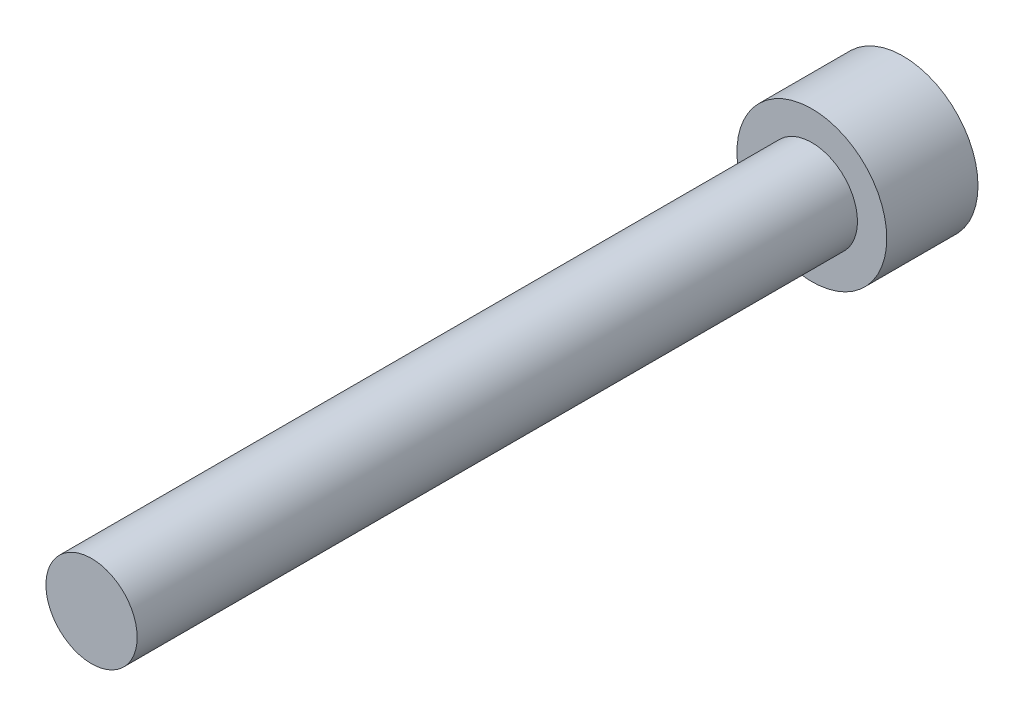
ISO-10303-21;
HEADER;
FILE_DESCRIPTION(('STEP AP214'),'2;1');
FILE_NAME('part.step','',(''),(''),'','','');
FILE_SCHEMA(('AUTOMOTIVE_DESIGN { 1 0 10303 214 1 1 1 1 }'));
ENDSEC;
DATA;
#1=APPLICATION_CONTEXT('core data for automotive mechanical design processes');
#2=APPLICATION_PROTOCOL_DEFINITION('international standard','automotive_design',2000,#1);
#3=PRODUCT_CONTEXT('',#1,'mechanical');
#4=PRODUCT('Part','Part','',(#3));
#5=PRODUCT_RELATED_PRODUCT_CATEGORY('part','',(#4));
#6=PRODUCT_DEFINITION_FORMATION('','',#4);
#7=PRODUCT_DEFINITION_CONTEXT('part definition',#1,'design');
#8=PRODUCT_DEFINITION('design','',#6,#7);
#9=PRODUCT_DEFINITION_SHAPE('','',#8);
#10=(LENGTH_UNIT() NAMED_UNIT(*) SI_UNIT(.MILLI.,.METRE.));
#11=(NAMED_UNIT(*) PLANE_ANGLE_UNIT() SI_UNIT($,.RADIAN.));
#12=(NAMED_UNIT(*) SI_UNIT($,.STERADIAN.) SOLID_ANGLE_UNIT());
#13=UNCERTAINTY_MEASURE_WITH_UNIT(LENGTH_MEASURE(1.E-05),#10,'distance_accuracy_value','');
#14=(GEOMETRIC_REPRESENTATION_CONTEXT(3) GLOBAL_UNCERTAINTY_ASSIGNED_CONTEXT((#13)) GLOBAL_UNIT_ASSIGNED_CONTEXT((#10,
#11,#12)) REPRESENTATION_CONTEXT('',''));
#15=CARTESIAN_POINT('',(0.,0.,0.));
#16=DIRECTION('',(0.,0.,1.));
#17=DIRECTION('',(1.,0.,0.));
#18=AXIS2_PLACEMENT_3D('',#15,#16,#17);
#19=CARTESIAN_POINT('',(0.,0.,38.1));
#20=DIRECTION('',(0.,0.,1.));
#21=DIRECTION('',(1.,0.,0.));
#22=AXIS2_PLACEMENT_3D('',#19,#20,#21);
#23=PLANE('',#22);
#24=CARTESIAN_POINT('',(0.,0.,38.1));
#25=DIRECTION('',(0.,0.,1.));
#26=DIRECTION('',(1.,0.,0.));
#27=AXIS2_PLACEMENT_3D('',#24,#25,#26);
#28=CIRCLE('',#27,2.413);
#29=CARTESIAN_POINT('',(2.413,0.,38.1));
#30=VERTEX_POINT('',#29);
#31=EDGE_CURVE('E11',#30,#30,#28,.T.);
#32=ORIENTED_EDGE('',*,*,#31,.T.);
#33=EDGE_LOOP('',(#32));
#34=FACE_BOUND('',#33,.T.);
#35=ADVANCED_FACE('F37',(#34),#23,.T.);
#36=CARTESIAN_POINT('',(0.,0.,38.1));
#37=DIRECTION('',(0.,0.,1.));
#38=DIRECTION('',(1.,0.,0.));
#39=AXIS2_PLACEMENT_3D('',#36,#37,#38);
#40=CYLINDRICAL_SURFACE('',#39,2.413);
#41=CARTESIAN_POINT('',(0.,0.,0.));
#42=DIRECTION('',(0.,0.,1.));
#43=DIRECTION('',(1.,0.,0.));
#44=AXIS2_PLACEMENT_3D('',#41,#42,#43);
#45=CIRCLE('',#44,2.413);
#46=CARTESIAN_POINT('',(2.413,0.,0.));
#47=VERTEX_POINT('',#46);
#48=EDGE_CURVE('E44',#47,#47,#45,.T.);
#49=ORIENTED_EDGE('',*,*,#48,.T.);
#50=EDGE_LOOP('',(#49));
#51=FACE_BOUND('',#50,.T.);
#52=ORIENTED_EDGE('',*,*,#31,.F.);
#53=EDGE_LOOP('',(#52));
#54=FACE_BOUND('',#53,.T.);
#55=ADVANCED_FACE('F151',(#51,#54),#40,.T.);
#56=CARTESIAN_POINT('',(0.,-2.413,0.));
#57=DIRECTION('',(0.,0.,1.));
#58=DIRECTION('',(1.,0.,0.));
#59=AXIS2_PLACEMENT_3D('',#56,#57,#58);
#60=PLANE('',#59);
#61=CARTESIAN_POINT('',(0.,0.,0.));
#62=DIRECTION('',(0.,0.,1.));
#63=DIRECTION('',(1.,0.,0.));
#64=AXIS2_PLACEMENT_3D('',#61,#62,#63);
#65=CIRCLE('',#64,3.9624);
#66=CARTESIAN_POINT('',(3.9624,0.,0.));
#67=VERTEX_POINT('',#66);
#68=EDGE_CURVE('E146',#67,#67,#65,.T.);
#69=ORIENTED_EDGE('',*,*,#68,.T.);
#70=EDGE_LOOP('',(#69));
#71=FACE_BOUND('',#70,.T.);
#72=ORIENTED_EDGE('',*,*,#48,.F.);
#73=EDGE_LOOP('',(#72));
#74=FACE_BOUND('',#73,.T.);
#75=ADVANCED_FACE('F154',(#71,#74),#60,.T.);
#76=CARTESIAN_POINT('',(0.,0.,38.1));
#77=DIRECTION('',(0.,0.,1.));
#78=DIRECTION('',(1.,0.,0.));
#79=AXIS2_PLACEMENT_3D('',#76,#77,#78);
#80=CYLINDRICAL_SURFACE('',#79,3.9624);
#81=CARTESIAN_POINT('',(0.,0.,-4.826));
#82=DIRECTION('',(0.,0.,1.));
#83=DIRECTION('',(1.,0.,0.));
#84=AXIS2_PLACEMENT_3D('',#81,#82,#83);
#85=CIRCLE('',#84,3.9624);
#86=CARTESIAN_POINT('',(3.9624,0.,-4.826));
#87=VERTEX_POINT('',#86);
#88=EDGE_CURVE('E138',#87,#87,#85,.T.);
#89=ORIENTED_EDGE('',*,*,#88,.T.);
#90=EDGE_LOOP('',(#89));
#91=FACE_BOUND('',#90,.T.);
#92=ORIENTED_EDGE('',*,*,#68,.F.);
#93=EDGE_LOOP('',(#92));
#94=FACE_BOUND('',#93,.T.);
#95=ADVANCED_FACE('F156',(#91,#94),#80,.T.);
#96=CARTESIAN_POINT('',(0.,-3.9624,-4.826));
#97=DIRECTION('',(0.,0.,-1.));
#98=DIRECTION('',(-1.,0.,0.));
#99=AXIS2_PLACEMENT_3D('',#96,#97,#98);
#100=PLANE('',#99);
#101=DIRECTION('',(0.866025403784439,-0.5,0.));
#102=VECTOR('',#101,1.);
#103=CARTESIAN_POINT('',(0.,2.28769270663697,-4.826));
#104=LINE('',#103,#102);
#105=CARTESIAN_POINT('',(0.,2.28769270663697,-4.826));
#106=VERTEX_POINT('',#105);
#107=CARTESIAN_POINT('',(1.9812,1.14384635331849,-4.826));
#108=VERTEX_POINT('',#107);
#109=EDGE_CURVE('E51',#106,#108,#104,.T.);
#110=ORIENTED_EDGE('',*,*,#109,.F.);
#111=DIRECTION('',(0.866025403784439,0.5,0.));
#112=VECTOR('',#111,1.);
#113=CARTESIAN_POINT('',(-1.9812,1.14384635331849,-4.826));
#114=LINE('',#113,#112);
#115=CARTESIAN_POINT('',(-1.9812,1.14384635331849,-4.826));
#116=VERTEX_POINT('',#115);
#117=EDGE_CURVE('E134',#116,#106,#114,.T.);
#118=ORIENTED_EDGE('',*,*,#117,.F.);
#119=DIRECTION('',(0.,1.,0.));
#120=VECTOR('',#119,1.);
#121=CARTESIAN_POINT('',(-1.9812,-1.14384635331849,-4.826));
#122=LINE('',#121,#120);
#123=CARTESIAN_POINT('',(-1.9812,-1.14384635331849,-4.826));
#124=VERTEX_POINT('',#123);
#125=EDGE_CURVE('E132',#124,#116,#122,.T.);
#126=ORIENTED_EDGE('',*,*,#125,.F.);
#127=DIRECTION('',(-0.866025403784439,0.5,0.));
#128=VECTOR('',#127,1.);
#129=CARTESIAN_POINT('',(0.,-2.28769270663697,-4.826));
#130=LINE('',#129,#128);
#131=CARTESIAN_POINT('',(0.,-2.28769270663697,-4.826));
#132=VERTEX_POINT('',#131);
#133=EDGE_CURVE('E99',#132,#124,#130,.T.);
#134=ORIENTED_EDGE('',*,*,#133,.F.);
#135=DIRECTION('',(-0.866025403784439,-0.5,0.));
#136=VECTOR('',#135,1.);
#137=CARTESIAN_POINT('',(1.9812,-1.14384635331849,-4.826));
#138=LINE('',#137,#136);
#139=CARTESIAN_POINT('',(1.9812,-1.14384635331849,-4.826));
#140=VERTEX_POINT('',#139);
#141=EDGE_CURVE('E128',#140,#132,#138,.T.);
#142=ORIENTED_EDGE('',*,*,#141,.F.);
#143=DIRECTION('',(0.,-1.,0.));
#144=VECTOR('',#143,1.);
#145=CARTESIAN_POINT('',(1.9812,1.14384635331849,-4.826));
#146=LINE('',#145,#144);
#147=EDGE_CURVE('E125',#108,#140,#146,.T.);
#148=ORIENTED_EDGE('',*,*,#147,.F.);
#149=EDGE_LOOP('',(#110,#118,#126,#134,#142,#148));
#150=FACE_BOUND('',#149,.T.);
#151=ORIENTED_EDGE('',*,*,#88,.F.);
#152=EDGE_LOOP('',(#151));
#153=FACE_BOUND('',#152,.T.);
#154=ADVANCED_FACE('F163',(#150,#153),#100,.T.);
#155=CARTESIAN_POINT('',(0.,2.28769270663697,-1.778));
#156=DIRECTION('',(0.5,0.866025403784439,0.));
#157=DIRECTION('',(-0.866025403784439,0.5,0.));
#158=AXIS2_PLACEMENT_3D('',#155,#156,#157);
#159=PLANE('',#158);
#160=ORIENTED_EDGE('',*,*,#109,.T.);
#161=DIRECTION('',(0.,0.,-1.));
#162=VECTOR('',#161,1.);
#163=CARTESIAN_POINT('',(1.9812,1.14384635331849,-1.778));
#164=LINE('',#163,#162);
#165=CARTESIAN_POINT('',(1.9812,1.14384635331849,-1.778));
#166=VERTEX_POINT('',#165);
#167=EDGE_CURVE('E81',#166,#108,#164,.T.);
#168=ORIENTED_EDGE('',*,*,#167,.F.);
#169=DIRECTION('',(0.866025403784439,-0.5,0.));
#170=VECTOR('',#169,1.);
#171=CARTESIAN_POINT('',(0.,2.28769270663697,-1.778));
#172=LINE('',#171,#170);
#173=CARTESIAN_POINT('',(0.,2.28769270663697,-1.778));
#174=VERTEX_POINT('',#173);
#175=EDGE_CURVE('E136',#174,#166,#172,.T.);
#176=ORIENTED_EDGE('',*,*,#175,.F.);
#177=DIRECTION('',(0.,0.,-1.));
#178=VECTOR('',#177,1.);
#179=CARTESIAN_POINT('',(0.,2.28769270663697,-1.778));
#180=LINE('',#179,#178);
#181=EDGE_CURVE('E59',#174,#106,#180,.T.);
#182=ORIENTED_EDGE('',*,*,#181,.T.);
#183=EDGE_LOOP('',(#160,#168,#176,#182));
#184=FACE_BOUND('',#183,.T.);
#185=ADVANCED_FACE('F197',(#184),#159,.F.);
#186=CARTESIAN_POINT('',(-1.9812,1.14384635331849,-1.778));
#187=DIRECTION('',(-0.5,0.866025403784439,0.));
#188=DIRECTION('',(-0.866025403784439,-0.5,0.));
#189=AXIS2_PLACEMENT_3D('',#186,#187,#188);
#190=PLANE('',#189);
#191=ORIENTED_EDGE('',*,*,#117,.T.);
#192=ORIENTED_EDGE('',*,*,#181,.F.);
#193=DIRECTION('',(0.866025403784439,0.5,0.));
#194=VECTOR('',#193,1.);
#195=CARTESIAN_POINT('',(-1.9812,1.14384635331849,-1.778));
#196=LINE('',#195,#194);
#197=CARTESIAN_POINT('',(-1.9812,1.14384635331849,-1.778));
#198=VERTEX_POINT('',#197);
#199=EDGE_CURVE('E111',#198,#174,#196,.T.);
#200=ORIENTED_EDGE('',*,*,#199,.F.);
#201=DIRECTION('',(0.,0.,-1.));
#202=VECTOR('',#201,1.);
#203=CARTESIAN_POINT('',(-1.9812,1.14384635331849,-1.778));
#204=LINE('',#203,#202);
#205=EDGE_CURVE('E103',#198,#116,#204,.T.);
#206=ORIENTED_EDGE('',*,*,#205,.T.);
#207=EDGE_LOOP('',(#191,#192,#200,#206));
#208=FACE_BOUND('',#207,.T.);
#209=ADVANCED_FACE('F208',(#208),#190,.F.);
#210=CARTESIAN_POINT('',(-1.9812,-1.14384635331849,-1.778));
#211=DIRECTION('',(-1.,0.,0.));
#212=DIRECTION('',(0.,-1.,0.));
#213=AXIS2_PLACEMENT_3D('',#210,#211,#212);
#214=PLANE('',#213);
#215=ORIENTED_EDGE('',*,*,#125,.T.);
#216=ORIENTED_EDGE('',*,*,#205,.F.);
#217=DIRECTION('',(0.,1.,0.));
#218=VECTOR('',#217,1.);
#219=CARTESIAN_POINT('',(-1.9812,-1.14384635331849,-1.778));
#220=LINE('',#219,#218);
#221=CARTESIAN_POINT('',(-1.9812,-1.14384635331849,-1.778));
#222=VERTEX_POINT('',#221);
#223=EDGE_CURVE('E107',#222,#198,#220,.T.);
#224=ORIENTED_EDGE('',*,*,#223,.F.);
#225=DIRECTION('',(0.,0.,-1.));
#226=VECTOR('',#225,1.);
#227=CARTESIAN_POINT('',(-1.9812,-1.14384635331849,-1.778));
#228=LINE('',#227,#226);
#229=EDGE_CURVE('E92',#222,#124,#228,.T.);
#230=ORIENTED_EDGE('',*,*,#229,.T.);
#231=EDGE_LOOP('',(#215,#216,#224,#230));
#232=FACE_BOUND('',#231,.T.);
#233=ADVANCED_FACE('F108',(#232),#214,.F.);
#234=CARTESIAN_POINT('',(0.,-2.28769270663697,-1.778));
#235=DIRECTION('',(-0.5,-0.866025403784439,0.));
#236=DIRECTION('',(0.866025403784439,-0.5,0.));
#237=AXIS2_PLACEMENT_3D('',#234,#235,#236);
#238=PLANE('',#237);
#239=ORIENTED_EDGE('',*,*,#133,.T.);
#240=ORIENTED_EDGE('',*,*,#229,.F.);
#241=DIRECTION('',(-0.866025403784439,0.5,0.));
#242=VECTOR('',#241,1.);
#243=CARTESIAN_POINT('',(0.,-2.28769270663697,-1.778));
#244=LINE('',#243,#242);
#245=CARTESIAN_POINT('',(0.,-2.28769270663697,-1.778));
#246=VERTEX_POINT('',#245);
#247=EDGE_CURVE('E96',#246,#222,#244,.T.);
#248=ORIENTED_EDGE('',*,*,#247,.F.);
#249=DIRECTION('',(0.,0.,-1.));
#250=VECTOR('',#249,1.);
#251=CARTESIAN_POINT('',(0.,-2.28769270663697,-1.778));
#252=LINE('',#251,#250);
#253=EDGE_CURVE('E104',#246,#132,#252,.T.);
#254=ORIENTED_EDGE('',*,*,#253,.T.);
#255=EDGE_LOOP('',(#239,#240,#248,#254));
#256=FACE_BOUND('',#255,.T.);
#257=ADVANCED_FACE('F94',(#256),#238,.F.);
#258=CARTESIAN_POINT('',(1.9812,-1.14384635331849,-1.778));
#259=DIRECTION('',(0.5,-0.866025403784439,0.));
#260=DIRECTION('',(0.866025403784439,0.5,0.));
#261=AXIS2_PLACEMENT_3D('',#258,#259,#260);
#262=PLANE('',#261);
#263=ORIENTED_EDGE('',*,*,#141,.T.);
#264=ORIENTED_EDGE('',*,*,#253,.F.);
#265=DIRECTION('',(-0.866025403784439,-0.5,0.));
#266=VECTOR('',#265,1.);
#267=CARTESIAN_POINT('',(1.9812,-1.14384635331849,-1.778));
#268=LINE('',#267,#266);
#269=CARTESIAN_POINT('',(1.9812,-1.14384635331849,-1.778));
#270=VERTEX_POINT('',#269);
#271=EDGE_CURVE('E117',#270,#246,#268,.T.);
#272=ORIENTED_EDGE('',*,*,#271,.F.);
#273=DIRECTION('',(0.,0.,-1.));
#274=VECTOR('',#273,1.);
#275=CARTESIAN_POINT('',(1.9812,-1.14384635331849,-1.778));
#276=LINE('',#275,#274);
#277=EDGE_CURVE('E141',#270,#140,#276,.T.);
#278=ORIENTED_EDGE('',*,*,#277,.T.);
#279=EDGE_LOOP('',(#263,#264,#272,#278));
#280=FACE_BOUND('',#279,.T.);
#281=ADVANCED_FACE('F236',(#280),#262,.F.);
#282=CARTESIAN_POINT('',(1.9812,1.14384635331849,-1.778));
#283=DIRECTION('',(1.,0.,0.));
#284=DIRECTION('',(0.,0.,-1.));
#285=AXIS2_PLACEMENT_3D('',#282,#283,#284);
#286=PLANE('',#285);
#287=ORIENTED_EDGE('',*,*,#147,.T.);
#288=ORIENTED_EDGE('',*,*,#277,.F.);
#289=DIRECTION('',(0.,-1.,0.));
#290=VECTOR('',#289,1.);
#291=CARTESIAN_POINT('',(1.9812,1.14384635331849,-1.778));
#292=LINE('',#291,#290);
#293=EDGE_CURVE('E119',#166,#270,#292,.T.);
#294=ORIENTED_EDGE('',*,*,#293,.F.);
#295=ORIENTED_EDGE('',*,*,#167,.T.);
#296=EDGE_LOOP('',(#287,#288,#294,#295));
#297=FACE_BOUND('',#296,.T.);
#298=ADVANCED_FACE('F246',(#297),#286,.F.);
#299=CARTESIAN_POINT('',(3.9624,0.,-1.778));
#300=DIRECTION('',(0.,0.,-1.));
#301=DIRECTION('',(-1.,0.,0.));
#302=AXIS2_PLACEMENT_3D('',#299,#300,#301);
#303=PLANE('',#302);
#304=ORIENTED_EDGE('',*,*,#175,.T.);
#305=ORIENTED_EDGE('',*,*,#293,.T.);
#306=ORIENTED_EDGE('',*,*,#271,.T.);
#307=ORIENTED_EDGE('',*,*,#247,.T.);
#308=ORIENTED_EDGE('',*,*,#223,.T.);
#309=ORIENTED_EDGE('',*,*,#199,.T.);
#310=EDGE_LOOP('',(#304,#305,#306,#307,#308,#309));
#311=FACE_BOUND('',#310,.T.);
#312=ADVANCED_FACE('F114',(#311),#303,.T.);
#313=CLOSED_SHELL('',(#35,#55,#75,#95,#154,#185,#209,#233,#257,#281,#298,#312));
#314=MANIFOLD_SOLID_BREP('B2',#313);
#315=ADVANCED_BREP_SHAPE_REPRESENTATION('',(#18,#314),#14);
#316=SHAPE_DEFINITION_REPRESENTATION(#9,#315);
ENDSEC;
END-ISO-10303-21;
